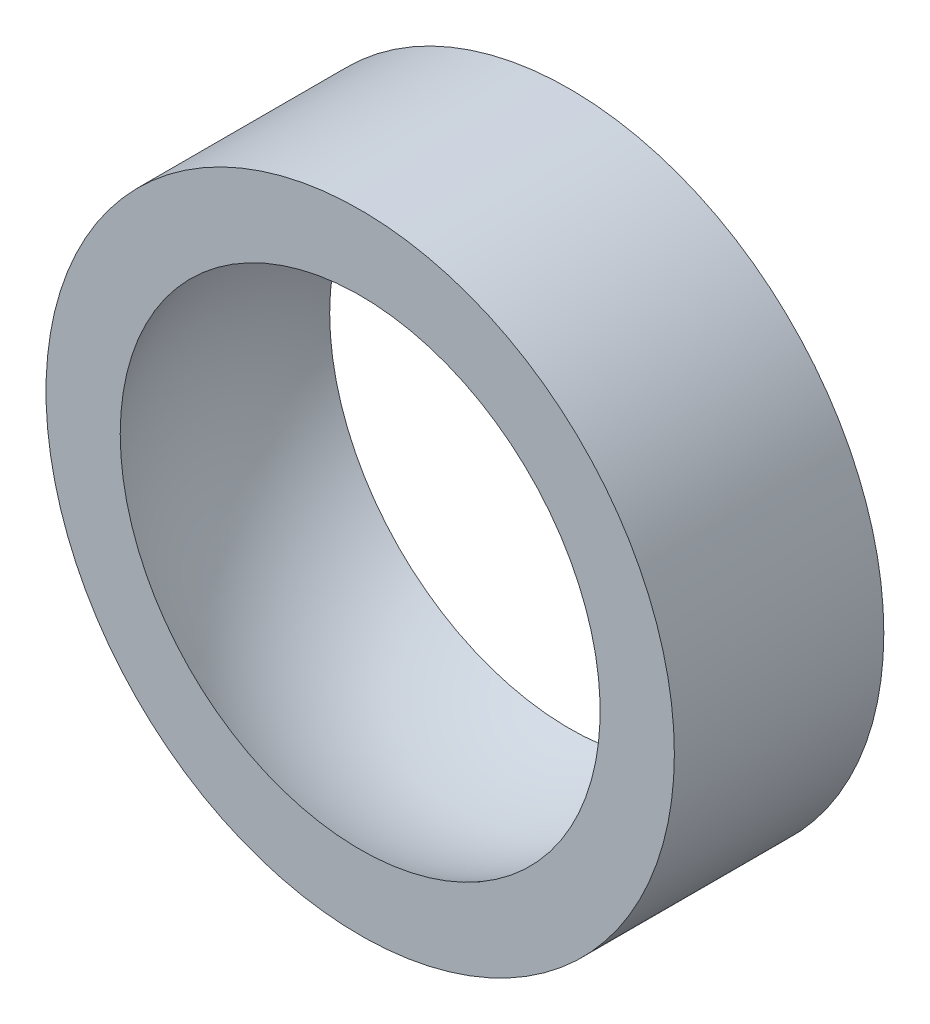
ISO-10303-21;
HEADER;
FILE_DESCRIPTION(('STEP AP214'),'2;1');
FILE_NAME('part.step','',(''),(''),'','','');
FILE_SCHEMA(('AUTOMOTIVE_DESIGN { 1 0 10303 214 1 1 1 1 }'));
ENDSEC;
DATA;
#1=APPLICATION_CONTEXT('core data for automotive mechanical design processes');
#2=APPLICATION_PROTOCOL_DEFINITION('international standard','automotive_design',2000,#1);
#3=PRODUCT_CONTEXT('',#1,'mechanical');
#4=PRODUCT('Part','Part','',(#3));
#5=PRODUCT_RELATED_PRODUCT_CATEGORY('part','',(#4));
#6=PRODUCT_DEFINITION_FORMATION('','',#4);
#7=PRODUCT_DEFINITION_CONTEXT('part definition',#1,'design');
#8=PRODUCT_DEFINITION('design','',#6,#7);
#9=PRODUCT_DEFINITION_SHAPE('','',#8);
#10=(LENGTH_UNIT() NAMED_UNIT(*) SI_UNIT(.MILLI.,.METRE.));
#11=(NAMED_UNIT(*) PLANE_ANGLE_UNIT() SI_UNIT($,.RADIAN.));
#12=(NAMED_UNIT(*) SI_UNIT($,.STERADIAN.) SOLID_ANGLE_UNIT());
#13=UNCERTAINTY_MEASURE_WITH_UNIT(LENGTH_MEASURE(1.E-05),#10,'distance_accuracy_value','');
#14=(GEOMETRIC_REPRESENTATION_CONTEXT(3) GLOBAL_UNCERTAINTY_ASSIGNED_CONTEXT((#13)) GLOBAL_UNIT_ASSIGNED_CONTEXT((#10,
#11,#12)) REPRESENTATION_CONTEXT('',''));
#15=CARTESIAN_POINT('',(0.,0.,0.));
#16=DIRECTION('',(0.,0.,1.));
#17=DIRECTION('',(1.,0.,0.));
#18=AXIS2_PLACEMENT_3D('',#15,#16,#17);
#19=CARTESIAN_POINT('',(0.,0.,5.));
#20=DIRECTION('',(0.,0.,1.));
#21=DIRECTION('',(1.,0.,0.));
#22=AXIS2_PLACEMENT_3D('',#19,#20,#21);
#23=PLANE('',#22);
#24=CARTESIAN_POINT('',(0.,0.,5.));
#25=DIRECTION('',(0.,0.,1.));
#26=DIRECTION('',(1.,0.,0.));
#27=AXIS2_PLACEMENT_3D('',#24,#25,#26);
#28=CIRCLE('',#27,15.);
#29=CARTESIAN_POINT('',(15.,0.,5.));
#30=VERTEX_POINT('',#29);
#31=EDGE_CURVE('E10',#30,#30,#28,.T.);
#32=ORIENTED_EDGE('',*,*,#31,.T.);
#33=EDGE_LOOP('',(#32));
#34=FACE_BOUND('',#33,.T.);
#35=CARTESIAN_POINT('',(0.,0.,5.));
#36=DIRECTION('',(0.,0.,1.));
#37=DIRECTION('',(1.,0.,0.));
#38=AXIS2_PLACEMENT_3D('',#35,#36,#37);
#39=CIRCLE('',#38,11.4564392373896);
#40=CARTESIAN_POINT('',(-11.4564392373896,0.,5.));
#41=VERTEX_POINT('',#40);
#42=EDGE_CURVE('E40',#41,#41,#39,.F.);
#43=ORIENTED_EDGE('',*,*,#42,.T.);
#44=EDGE_LOOP('',(#43));
#45=FACE_BOUND('',#44,.T.);
#46=ADVANCED_FACE('F28',(#34,#45),#23,.T.);
#47=CARTESIAN_POINT('',(0.,0.,-5.));
#48=DIRECTION('',(0.,0.,1.));
#49=DIRECTION('',(1.,0.,0.));
#50=AXIS2_PLACEMENT_3D('',#47,#48,#49);
#51=PLANE('',#50);
#52=CARTESIAN_POINT('',(0.,0.,-5.));
#53=DIRECTION('',(0.,0.,1.));
#54=DIRECTION('',(1.,0.,0.));
#55=AXIS2_PLACEMENT_3D('',#52,#53,#54);
#56=CIRCLE('',#55,15.);
#57=CARTESIAN_POINT('',(15.,0.,-5.));
#58=VERTEX_POINT('',#57);
#59=EDGE_CURVE('E36',#58,#58,#56,.T.);
#60=ORIENTED_EDGE('',*,*,#59,.F.);
#61=EDGE_LOOP('',(#60));
#62=FACE_BOUND('',#61,.T.);
#63=CARTESIAN_POINT('',(0.,0.,-5.));
#64=DIRECTION('',(0.,0.,1.));
#65=DIRECTION('',(1.,0.,0.));
#66=AXIS2_PLACEMENT_3D('',#63,#64,#65);
#67=CIRCLE('',#66,11.4564392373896);
#68=CARTESIAN_POINT('',(-11.4564392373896,0.,-5.));
#69=VERTEX_POINT('',#68);
#70=EDGE_CURVE('E32',#69,#69,#67,.F.);
#71=ORIENTED_EDGE('',*,*,#70,.F.);
#72=EDGE_LOOP('',(#71));
#73=FACE_BOUND('',#72,.T.);
#74=ADVANCED_FACE('F51',(#62,#73),#51,.F.);
#75=CARTESIAN_POINT('',(0.,0.,5.));
#76=DIRECTION('',(0.,0.,-1.));
#77=DIRECTION('',(-1.,0.,0.));
#78=AXIS2_PLACEMENT_3D('',#75,#76,#77);
#79=CYLINDRICAL_SURFACE('',#78,15.);
#80=ORIENTED_EDGE('',*,*,#31,.F.);
#81=EDGE_LOOP('',(#80));
#82=FACE_BOUND('',#81,.T.);
#83=ORIENTED_EDGE('',*,*,#59,.T.);
#84=EDGE_LOOP('',(#83));
#85=FACE_BOUND('',#84,.T.);
#86=ADVANCED_FACE('F30',(#82,#85),#79,.T.);
#87=CARTESIAN_POINT('',(0.,0.,0.));
#88=DIRECTION('',(0.,0.,-1.));
#89=DIRECTION('',(-1.,0.,0.));
#90=AXIS2_PLACEMENT_3D('',#87,#88,#89);
#91=SPHERICAL_SURFACE('',#90,12.5);
#92=CARTESIAN_POINT('',(-11.4564392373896,0.,5.));
#93=CARTESIAN_POINT('',(-11.4993058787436,0.,4.90178100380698));
#94=CARTESIAN_POINT('',(-11.5409088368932,0.,4.80301050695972));
#95=CARTESIAN_POINT('',(-11.6215611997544,0.,4.6044323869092));
#96=CARTESIAN_POINT('',(-11.6606106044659,0.,4.50462476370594));
#97=CARTESIAN_POINT('',(-11.7361296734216,0.,4.30403826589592));
#98=CARTESIAN_POINT('',(-11.7725993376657,0.,4.20325939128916));
#99=CARTESIAN_POINT('',(-11.8429348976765,0.,4.0007970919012));
#100=CARTESIAN_POINT('',(-11.8768007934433,0.,3.89911366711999));
#101=CARTESIAN_POINT('',(-11.9419063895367,0.,3.69490951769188));
#102=CARTESIAN_POINT('',(-11.9731460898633,0.,3.59238879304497));
#103=CARTESIAN_POINT('',(-12.0329786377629,0.,3.3865778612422));
#104=CARTESIAN_POINT('',(-12.0615714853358,0.,3.28328765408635));
#105=CARTESIAN_POINT('',(-12.1160914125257,0.,3.0760060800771));
#106=CARTESIAN_POINT('',(-12.1420184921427,0.,2.97201471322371));
#107=CARTESIAN_POINT('',(-12.1911897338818,0.,2.7633996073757));
#108=CARTESIAN_POINT('',(-12.2144338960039,0.,2.65877586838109));
#109=CARTESIAN_POINT('',(-12.2582239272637,0.,2.44896522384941));
#110=CARTESIAN_POINT('',(-12.2787697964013,0.,2.34377831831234));
#111=CARTESIAN_POINT('',(-12.3171496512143,0.,2.13291091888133));
#112=CARTESIAN_POINT('',(-12.3349836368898,0.,2.02723042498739));
#113=CARTESIAN_POINT('',(-12.3679279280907,0.,1.81544575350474));
#114=CARTESIAN_POINT('',(-12.3830382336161,0.,1.70934157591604));
#115=CARTESIAN_POINT('',(-12.4105251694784,0.,1.49677972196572));
#116=CARTESIAN_POINT('',(-12.4229017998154,0.,1.39032204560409));
#117=CARTESIAN_POINT('',(-12.4449131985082,0.,1.17712361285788));
#118=CARTESIAN_POINT('',(-12.4545479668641,0.,1.07038285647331));
#119=CARTESIAN_POINT('',(-12.4710692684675,0.,0.856688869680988));
#120=CARTESIAN_POINT('',(-12.477955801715,0.,0.749735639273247));
#121=CARTESIAN_POINT('',(-12.4889760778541,0.,0.535687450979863));
#122=CARTESIAN_POINT('',(-12.4931098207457,0.,0.428592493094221));
#123=CARTESIAN_POINT('',(-12.4986217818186,0.,0.214331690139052));
#124=CARTESIAN_POINT('',(-12.5,0.,0.107165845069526));
#125=CARTESIAN_POINT('',(-12.5,0.,-0.107165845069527));
#126=CARTESIAN_POINT('',(-12.4986217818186,0.,-0.214331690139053));
#127=CARTESIAN_POINT('',(-12.4931098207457,0.,-0.428592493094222));
#128=CARTESIAN_POINT('',(-12.4889760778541,0.,-0.535687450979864));
#129=CARTESIAN_POINT('',(-12.477955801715,0.,-0.749735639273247));
#130=CARTESIAN_POINT('',(-12.4710692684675,0.,-0.856688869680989));
#131=CARTESIAN_POINT('',(-12.4545479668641,0.,-1.07038285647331));
#132=CARTESIAN_POINT('',(-12.4449131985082,0.,-1.17712361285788));
#133=CARTESIAN_POINT('',(-12.4229017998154,0.,-1.39032204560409));
#134=CARTESIAN_POINT('',(-12.4105251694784,0.,-1.49677972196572));
#135=CARTESIAN_POINT('',(-12.3830382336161,0.,-1.70934157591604));
#136=CARTESIAN_POINT('',(-12.3679279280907,0.,-1.81544575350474));
#137=CARTESIAN_POINT('',(-12.3349836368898,0.,-2.02723042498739));
#138=CARTESIAN_POINT('',(-12.3171496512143,0.,-2.13291091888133));
#139=CARTESIAN_POINT('',(-12.2787697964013,0.,-2.34377831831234));
#140=CARTESIAN_POINT('',(-12.2582239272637,0.,-2.44896522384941));
#141=CARTESIAN_POINT('',(-12.2144338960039,0.,-2.65877586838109));
#142=CARTESIAN_POINT('',(-12.1911897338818,0.,-2.7633996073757));
#143=CARTESIAN_POINT('',(-12.1420184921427,0.,-2.97201471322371));
#144=CARTESIAN_POINT('',(-12.1160914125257,0.,-3.0760060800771));
#145=CARTESIAN_POINT('',(-12.0615714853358,0.,-3.28328765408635));
#146=CARTESIAN_POINT('',(-12.0329786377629,0.,-3.38657786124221));
#147=CARTESIAN_POINT('',(-11.9731460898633,0.,-3.59238879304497));
#148=CARTESIAN_POINT('',(-11.9419063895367,0.,-3.69490951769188));
#149=CARTESIAN_POINT('',(-11.8768007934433,0.,-3.89911366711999));
#150=CARTESIAN_POINT('',(-11.8429348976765,0.,-4.0007970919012));
#151=CARTESIAN_POINT('',(-11.7725993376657,0.,-4.20325939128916));
#152=CARTESIAN_POINT('',(-11.7361296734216,0.,-4.30403826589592));
#153=CARTESIAN_POINT('',(-11.6606106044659,0.,-4.50462476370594));
#154=CARTESIAN_POINT('',(-11.6215611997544,0.,-4.6044323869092));
#155=CARTESIAN_POINT('',(-11.5409088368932,0.,-4.80301050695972));
#156=CARTESIAN_POINT('',(-11.4993058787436,0.,-4.90178100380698));
#157=CARTESIAN_POINT('',(-11.4564392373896,0.,-5.));
#158=B_SPLINE_CURVE_WITH_KNOTS('',3,(#92,#93,#94,#95,#96,#97,#98,#99,#100,#101,#102,#103,#104,
#105,#106,#107,#108,#109,#110,#111,#112,#113,#114,#115,#116,#117,#118,#119,#120,#121,#122,#123,
#124,#125,#126,#127,#128,#129,#130,#131,#132,#133,#134,#135,#136,#137,#138,#139,#140,#141,#142,
#143,#144,#145,#146,#147,#148,#149,#150,#151,#152,#153,#154,#155,#156,#157),.UNSPECIFIED.,.F.,
.F.,(4,2,2,2,2,2,2,2,2,2,2,2,2,2,2,2,2,2,2,2,2,2,2,2,2,2,2,2,2,2,2,2,4),(0.,0.321488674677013,
0.642977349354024,0.964466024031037,1.28595469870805,1.60744337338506,1.92893204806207,
2.25042072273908,2.5719093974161,2.89339807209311,3.21488674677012,3.53637542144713,
3.85786409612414,4.17935277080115,4.50084144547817,4.82233012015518,5.14381879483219,
5.4653074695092,5.78679614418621,6.10828481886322,6.42977349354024,6.75126216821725,
7.07275084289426,7.39423951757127,7.71572819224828,8.0372168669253,8.35870554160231,
8.68019421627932,9.00168289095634,9.32317156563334,9.64466024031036,9.96614891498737,
10.2876375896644),.UNSPECIFIED.);
#159=EDGE_CURVE('BSEAM49',#41,#69,#158,.T.);
#160=ORIENTED_EDGE('',*,*,#42,.F.);
#161=ORIENTED_EDGE('',*,*,#70,.T.);
#162=ORIENTED_EDGE('',*,*,#159,.T.);
#163=ORIENTED_EDGE('',*,*,#159,.F.);
#164=EDGE_LOOP('',(#160,#162,#161,#163));
#165=FACE_BOUND('',#164,.T.);
#166=ADVANCED_FACE('F49',(#165),#91,.F.);
#167=CLOSED_SHELL('',(#46,#74,#86,#166));
#168=MANIFOLD_SOLID_BREP('B2',#167);
#169=ADVANCED_BREP_SHAPE_REPRESENTATION('',(#18,#168),#14);
#170=SHAPE_DEFINITION_REPRESENTATION(#9,#169);
ENDSEC;
END-ISO-10303-21;
